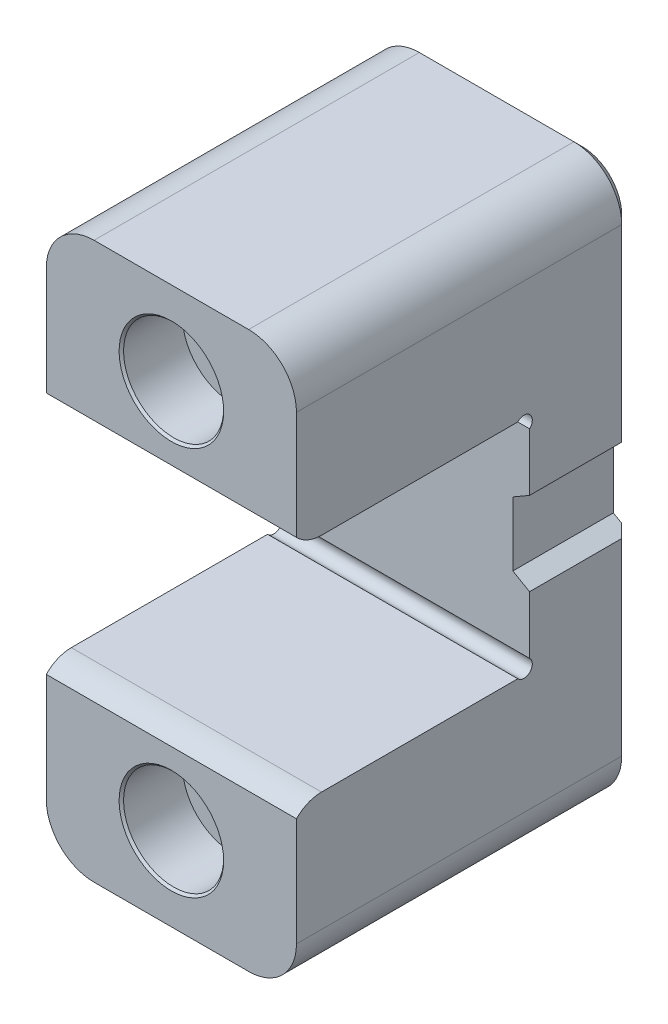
ISO-10303-21;
HEADER;
FILE_DESCRIPTION(('STEP AP214'),'2;1');
FILE_NAME('part.step','',(''),(''),'','','');
FILE_SCHEMA(('AUTOMOTIVE_DESIGN { 1 0 10303 214 1 1 1 1 }'));
ENDSEC;
DATA;
#1=APPLICATION_CONTEXT('core data for automotive mechanical design processes');
#2=APPLICATION_PROTOCOL_DEFINITION('international standard','automotive_design',2000,#1);
#3=PRODUCT_CONTEXT('',#1,'mechanical');
#4=PRODUCT('Part','Part','',(#3));
#5=PRODUCT_RELATED_PRODUCT_CATEGORY('part','',(#4));
#6=PRODUCT_DEFINITION_FORMATION('','',#4);
#7=PRODUCT_DEFINITION_CONTEXT('part definition',#1,'design');
#8=PRODUCT_DEFINITION('design','',#6,#7);
#9=PRODUCT_DEFINITION_SHAPE('','',#8);
#10=(LENGTH_UNIT() NAMED_UNIT(*) SI_UNIT(.MILLI.,.METRE.));
#11=(NAMED_UNIT(*) PLANE_ANGLE_UNIT() SI_UNIT($,.RADIAN.));
#12=(NAMED_UNIT(*) SI_UNIT($,.STERADIAN.) SOLID_ANGLE_UNIT());
#13=UNCERTAINTY_MEASURE_WITH_UNIT(LENGTH_MEASURE(1.E-05),#10,'distance_accuracy_value','');
#14=(GEOMETRIC_REPRESENTATION_CONTEXT(3) GLOBAL_UNCERTAINTY_ASSIGNED_CONTEXT((#13)) GLOBAL_UNIT_ASSIGNED_CONTEXT((#10,
#11,#12)) REPRESENTATION_CONTEXT('',''));
#15=CARTESIAN_POINT('',(0.,0.,0.));
#16=DIRECTION('',(0.,0.,1.));
#17=DIRECTION('',(1.,0.,0.));
#18=AXIS2_PLACEMENT_3D('',#15,#16,#17);
#19=CARTESIAN_POINT('',(22.5,-20.,0.));
#20=DIRECTION('',(-1.,0.,0.));
#21=DIRECTION('',(0.,0.,1.));
#22=AXIS2_PLACEMENT_3D('',#19,#20,#21);
#23=PLANE('',#22);
#24=DIRECTION('',(0.,0.,1.));
#25=VECTOR('',#24,1.);
#26=CARTESIAN_POINT('',(22.5,7.5,-60.));
#27=LINE('',#26,#25);
#28=CARTESIAN_POINT('',(22.5,7.5,-58.5));
#29=VERTEX_POINT('',#28);
#30=CARTESIAN_POINT('',(22.5,7.5,-41.92));
#31=VERTEX_POINT('',#30);
#32=EDGE_CURVE('E419',#29,#31,#27,.T.);
#33=ORIENTED_EDGE('',*,*,#32,.F.);
#34=DIRECTION('',(0.,1.,0.));
#35=VECTOR('',#34,1.);
#36=CARTESIAN_POINT('',(22.5,-20.,-58.5));
#37=LINE('',#36,#35);
#38=CARTESIAN_POINT('',(22.5,41.4,-58.5));
#39=VERTEX_POINT('',#38);
#40=EDGE_CURVE('E295',#29,#39,#37,.T.);
#41=ORIENTED_EDGE('',*,*,#40,.T.);
#42=DIRECTION('',(0.,0.,1.));
#43=VECTOR('',#42,1.);
#44=CARTESIAN_POINT('',(22.5,41.4,0.));
#45=LINE('',#44,#43);
#46=CARTESIAN_POINT('',(22.5,41.4,0.));
#47=VERTEX_POINT('',#46);
#48=EDGE_CURVE('E243',#39,#47,#45,.T.);
#49=ORIENTED_EDGE('',*,*,#48,.T.);
#50=DIRECTION('',(0.,-1.,0.));
#51=VECTOR('',#50,1.);
#52=CARTESIAN_POINT('',(22.5,50.,0.));
#53=LINE('',#52,#51);
#54=CARTESIAN_POINT('',(22.5,21.9169947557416,0.));
#55=VERTEX_POINT('',#54);
#56=EDGE_CURVE('E230',#47,#55,#53,.T.);
#57=ORIENTED_EDGE('',*,*,#56,.T.);
#58=CARTESIAN_POINT('',(22.5,26.2402017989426,-4.49999992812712));
#59=DIRECTION('',(-1.,0.,0.));
#60=DIRECTION('',(0.,0.,-1.));
#61=AXIS2_PLACEMENT_3D('',#58,#59,#60);
#62=CIRCLE('',#61,6.2402017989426);
#63=CARTESIAN_POINT('',(22.5,20.,-4.49999999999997));
#64=VERTEX_POINT('',#63);
#65=EDGE_CURVE('E466',#64,#55,#62,.T.);
#66=ORIENTED_EDGE('',*,*,#65,.F.);
#67=DIRECTION('',(0.,0.,-1.));
#68=VECTOR('',#67,1.);
#69=CARTESIAN_POINT('',(22.5,20.,0.));
#70=LINE('',#69,#68);
#71=CARTESIAN_POINT('',(22.5,20.,-39.8019660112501));
#72=VERTEX_POINT('',#71);
#73=EDGE_CURVE('E434',#64,#72,#70,.T.);
#74=ORIENTED_EDGE('',*,*,#73,.T.);
#75=CARTESIAN_POINT('',(22.5,19.,-40.92));
#76=DIRECTION('',(1.,0.,0.));
#77=DIRECTION('',(0.,0.,-1.));
#78=AXIS2_PLACEMENT_3D('',#75,#76,#77);
#79=CIRCLE('',#78,1.5);
#80=CARTESIAN_POINT('',(22.5,17.8819660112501,-41.92));
#81=VERTEX_POINT('',#80);
#82=EDGE_CURVE('E464',#81,#72,#79,.T.);
#83=ORIENTED_EDGE('',*,*,#82,.F.);
#84=DIRECTION('',(0.,-1.,0.));
#85=VECTOR('',#84,1.);
#86=CARTESIAN_POINT('',(22.5,20.,-41.92));
#87=LINE('',#86,#85);
#88=EDGE_CURVE('E438',#81,#31,#87,.T.);
#89=ORIENTED_EDGE('',*,*,#88,.T.);
#90=EDGE_LOOP('',(#33,#41,#49,#57,#66,#74,#83,#89));
#91=FACE_BOUND('',#90,.T.);
#92=ADVANCED_FACE('F33',(#91),#23,.F.);
#93=CARTESIAN_POINT('',(22.5,50.,0.));
#94=DIRECTION('',(0.,0.,-1.));
#95=DIRECTION('',(0.,1.,0.));
#96=AXIS2_PLACEMENT_3D('',#93,#94,#95);
#97=PLANE('',#96);
#98=CARTESIAN_POINT('',(0.,35.,0.));
#99=DIRECTION('',(0.,0.,-1.));
#100=DIRECTION('',(0.,1.,0.));
#101=AXIS2_PLACEMENT_3D('',#98,#99,#100);
#102=CIRCLE('',#101,9.40000000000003);
#103=CARTESIAN_POINT('',(0.,44.4,0.));
#104=VERTEX_POINT('',#103);
#105=EDGE_CURVE('E11',#104,#104,#102,.T.);
#106=ORIENTED_EDGE('',*,*,#105,.T.);
#107=EDGE_LOOP('',(#106));
#108=FACE_BOUND('',#107,.T.);
#109=DIRECTION('',(0.,-1.,0.));
#110=VECTOR('',#109,1.);
#111=CARTESIAN_POINT('',(-22.5,50.,0.));
#112=LINE('',#111,#110);
#113=CARTESIAN_POINT('',(-22.5,41.4,0.));
#114=VERTEX_POINT('',#113);
#115=CARTESIAN_POINT('',(-22.5,21.9169947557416,0.));
#116=VERTEX_POINT('',#115);
#117=EDGE_CURVE('E431',#114,#116,#112,.T.);
#118=ORIENTED_EDGE('',*,*,#117,.T.);
#119=DIRECTION('',(1.,0.,0.));
#120=VECTOR('',#119,1.);
#121=CARTESIAN_POINT('',(-22.5,21.9169947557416,0.));
#122=LINE('',#121,#120);
#123=EDGE_CURVE('E472',#116,#55,#122,.T.);
#124=ORIENTED_EDGE('',*,*,#123,.T.);
#125=ORIENTED_EDGE('',*,*,#56,.F.);
#126=CARTESIAN_POINT('',(13.9,41.4,0.));
#127=DIRECTION('',(0.,0.,-1.));
#128=DIRECTION('',(0.,1.,0.));
#129=AXIS2_PLACEMENT_3D('',#126,#127,#128);
#130=CIRCLE('',#129,8.6);
#131=CARTESIAN_POINT('',(13.9,50.,0.));
#132=VERTEX_POINT('',#131);
#133=EDGE_CURVE('E260',#47,#132,#130,.F.);
#134=ORIENTED_EDGE('',*,*,#133,.T.);
#135=DIRECTION('',(-1.,0.,0.));
#136=VECTOR('',#135,1.);
#137=CARTESIAN_POINT('',(22.5,50.,0.));
#138=LINE('',#137,#136);
#139=CARTESIAN_POINT('',(-13.9,50.,0.));
#140=VERTEX_POINT('',#139);
#141=EDGE_CURVE('E236',#132,#140,#138,.T.);
#142=ORIENTED_EDGE('',*,*,#141,.T.);
#143=CARTESIAN_POINT('',(-13.9,41.4,0.));
#144=DIRECTION('',(0.,0.,-1.));
#145=DIRECTION('',(0.,1.,0.));
#146=AXIS2_PLACEMENT_3D('',#143,#144,#145);
#147=CIRCLE('',#146,8.6);
#148=EDGE_CURVE('E258',#140,#114,#147,.F.);
#149=ORIENTED_EDGE('',*,*,#148,.T.);
#150=EDGE_LOOP('',(#118,#124,#125,#134,#142,#149));
#151=FACE_BOUND('',#150,.T.);
#152=ADVANCED_FACE('F357',(#108,#151),#97,.F.);
#153=CARTESIAN_POINT('',(22.5,20.,0.));
#154=DIRECTION('',(0.,1.,0.));
#155=DIRECTION('',(0.,0.,1.));
#156=AXIS2_PLACEMENT_3D('',#153,#154,#155);
#157=PLANE('',#156);
#158=DIRECTION('',(0.,0.,-1.));
#159=VECTOR('',#158,1.);
#160=CARTESIAN_POINT('',(-22.5,20.,0.));
#161=LINE('',#160,#159);
#162=CARTESIAN_POINT('',(-22.5,20.,-4.49999999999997));
#163=VERTEX_POINT('',#162);
#164=CARTESIAN_POINT('',(-22.5,20.,-39.8019660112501));
#165=VERTEX_POINT('',#164);
#166=EDGE_CURVE('E232',#163,#165,#161,.T.);
#167=ORIENTED_EDGE('',*,*,#166,.T.);
#168=DIRECTION('',(1.,0.,0.));
#169=VECTOR('',#168,1.);
#170=CARTESIAN_POINT('',(-22.5,20.,-39.8019660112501));
#171=LINE('',#170,#169);
#172=EDGE_CURVE('E450',#165,#72,#171,.T.);
#173=ORIENTED_EDGE('',*,*,#172,.T.);
#174=ORIENTED_EDGE('',*,*,#73,.F.);
#175=DIRECTION('',(1.,0.,0.));
#176=VECTOR('',#175,1.);
#177=CARTESIAN_POINT('',(-22.5,20.,-4.49999999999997));
#178=LINE('',#177,#176);
#179=EDGE_CURVE('E451',#163,#64,#178,.T.);
#180=ORIENTED_EDGE('',*,*,#179,.F.);
#181=EDGE_LOOP('',(#167,#173,#174,#180));
#182=FACE_BOUND('',#181,.T.);
#183=ADVANCED_FACE('F364',(#182),#157,.F.);
#184=CARTESIAN_POINT('',(22.5,20.,-41.92));
#185=DIRECTION('',(0.,0.,-1.));
#186=DIRECTION('',(-1.,0.,0.));
#187=AXIS2_PLACEMENT_3D('',#184,#185,#186);
#188=PLANE('',#187);
#189=DIRECTION('',(0.,-1.,0.));
#190=VECTOR('',#189,1.);
#191=CARTESIAN_POINT('',(-22.5,20.,-41.92));
#192=LINE('',#191,#190);
#193=CARTESIAN_POINT('',(-22.5,17.8819660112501,-41.92));
#194=VERTEX_POINT('',#193);
#195=CARTESIAN_POINT('',(-22.5,-17.8819660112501,-41.92));
#196=VERTEX_POINT('',#195);
#197=EDGE_CURVE('E227',#194,#196,#192,.T.);
#198=ORIENTED_EDGE('',*,*,#197,.T.);
#199=DIRECTION('',(1.,0.,0.));
#200=VECTOR('',#199,1.);
#201=CARTESIAN_POINT('',(-22.5,-17.8819660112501,-41.92));
#202=LINE('',#201,#200);
#203=CARTESIAN_POINT('',(22.5,-17.8819660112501,-41.92));
#204=VERTEX_POINT('',#203);
#205=EDGE_CURVE('E207',#196,#204,#202,.T.);
#206=ORIENTED_EDGE('',*,*,#205,.T.);
#207=CARTESIAN_POINT('',(22.5,-7.5,-41.92));
#208=VERTEX_POINT('',#207);
#209=EDGE_CURVE('E437',#208,#204,#87,.T.);
#210=ORIENTED_EDGE('',*,*,#209,.F.);
#211=DIRECTION('',(-0.866025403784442,0.499999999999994,0.));
#212=VECTOR('',#211,1.);
#213=CARTESIAN_POINT('',(10.5921506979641,-0.625000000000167,-41.92));
#214=LINE('',#213,#212);
#215=CARTESIAN_POINT('',(19.5,-5.76794919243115,-41.92));
#216=VERTEX_POINT('',#215);
#217=EDGE_CURVE('E418',#208,#216,#214,.T.);
#218=ORIENTED_EDGE('',*,*,#217,.T.);
#219=DIRECTION('',(0.,1.,0.));
#220=VECTOR('',#219,1.);
#221=CARTESIAN_POINT('',(19.5,20.,-41.92));
#222=LINE('',#221,#220);
#223=CARTESIAN_POINT('',(19.5,5.76794919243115,-41.92));
#224=VERTEX_POINT('',#223);
#225=EDGE_CURVE('E428',#216,#224,#222,.T.);
#226=ORIENTED_EDGE('',*,*,#225,.T.);
#227=DIRECTION('',(0.866025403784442,0.499999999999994,0.));
#228=VECTOR('',#227,1.);
#229=CARTESIAN_POINT('',(27.9126587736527,10.6249999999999,-41.92));
#230=LINE('',#229,#228);
#231=EDGE_CURVE('E425',#224,#31,#230,.T.);
#232=ORIENTED_EDGE('',*,*,#231,.T.);
#233=ORIENTED_EDGE('',*,*,#88,.F.);
#234=DIRECTION('',(1.,0.,0.));
#235=VECTOR('',#234,1.);
#236=CARTESIAN_POINT('',(-22.5,17.8819660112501,-41.92));
#237=LINE('',#236,#235);
#238=EDGE_CURVE('E459',#81,#194,#237,.F.);
#239=ORIENTED_EDGE('',*,*,#238,.T.);
#240=EDGE_LOOP('',(#198,#206,#210,#218,#226,#232,#233,#239));
#241=FACE_BOUND('',#240,.T.);
#242=ADVANCED_FACE('F463',(#241),#188,.F.);
#243=CARTESIAN_POINT('',(22.5,-20.,-41.92));
#244=DIRECTION('',(0.,-1.,0.));
#245=DIRECTION('',(0.,0.,-1.));
#246=AXIS2_PLACEMENT_3D('',#243,#244,#245);
#247=PLANE('',#246);
#248=DIRECTION('',(0.,0.,1.));
#249=VECTOR('',#248,1.);
#250=CARTESIAN_POINT('',(22.5,-20.,-41.92));
#251=LINE('',#250,#249);
#252=CARTESIAN_POINT('',(22.5,-20.,-39.8019660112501));
#253=VERTEX_POINT('',#252);
#254=CARTESIAN_POINT('',(22.5,-20.,-4.49999999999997));
#255=VERTEX_POINT('',#254);
#256=EDGE_CURVE('E220',#253,#255,#251,.T.);
#257=ORIENTED_EDGE('',*,*,#256,.F.);
#258=DIRECTION('',(1.,0.,0.));
#259=VECTOR('',#258,1.);
#260=CARTESIAN_POINT('',(-22.5,-20.,-39.8019660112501));
#261=LINE('',#260,#259);
#262=CARTESIAN_POINT('',(-22.5,-20.,-39.8019660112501));
#263=VERTEX_POINT('',#262);
#264=EDGE_CURVE('E204',#253,#263,#261,.F.);
#265=ORIENTED_EDGE('',*,*,#264,.T.);
#266=DIRECTION('',(0.,0.,1.));
#267=VECTOR('',#266,1.);
#268=CARTESIAN_POINT('',(-22.5,-20.,-41.92));
#269=LINE('',#268,#267);
#270=CARTESIAN_POINT('',(-22.5,-20.,-4.49999999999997));
#271=VERTEX_POINT('',#270);
#272=EDGE_CURVE('E218',#263,#271,#269,.T.);
#273=ORIENTED_EDGE('',*,*,#272,.T.);
#274=DIRECTION('',(1.,0.,0.));
#275=VECTOR('',#274,1.);
#276=CARTESIAN_POINT('',(-22.5,-20.,-4.49999999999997));
#277=LINE('',#276,#275);
#278=EDGE_CURVE('E479',#271,#255,#277,.T.);
#279=ORIENTED_EDGE('',*,*,#278,.T.);
#280=EDGE_LOOP('',(#257,#265,#273,#279));
#281=FACE_BOUND('',#280,.T.);
#282=ADVANCED_FACE('F216',(#281),#247,.F.);
#283=CARTESIAN_POINT('',(22.5,-20.,0.));
#284=DIRECTION('',(0.,0.,-1.));
#285=DIRECTION('',(0.,1.,0.));
#286=AXIS2_PLACEMENT_3D('',#283,#284,#285);
#287=PLANE('',#286);
#288=CARTESIAN_POINT('',(0.,-35.,0.));
#289=DIRECTION('',(0.,0.,-1.));
#290=DIRECTION('',(0.,1.,0.));
#291=AXIS2_PLACEMENT_3D('',#288,#289,#290);
#292=CIRCLE('',#291,9.4);
#293=CARTESIAN_POINT('',(0.,-25.6,0.));
#294=VERTEX_POINT('',#293);
#295=EDGE_CURVE('E339',#294,#294,#292,.T.);
#296=ORIENTED_EDGE('',*,*,#295,.T.);
#297=EDGE_LOOP('',(#296));
#298=FACE_BOUND('',#297,.T.);
#299=DIRECTION('',(0.,-1.,0.));
#300=VECTOR('',#299,1.);
#301=CARTESIAN_POINT('',(22.5,-20.,0.));
#302=LINE('',#301,#300);
#303=CARTESIAN_POINT('',(22.5,-21.9169947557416,0.));
#304=VERTEX_POINT('',#303);
#305=CARTESIAN_POINT('',(22.5,-41.4,0.));
#306=VERTEX_POINT('',#305);
#307=EDGE_CURVE('E240',#304,#306,#302,.T.);
#308=ORIENTED_EDGE('',*,*,#307,.F.);
#309=DIRECTION('',(1.,0.,0.));
#310=VECTOR('',#309,1.);
#311=CARTESIAN_POINT('',(-22.5,-21.9169947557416,0.));
#312=LINE('',#311,#310);
#313=CARTESIAN_POINT('',(-22.5,-21.9169947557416,0.));
#314=VERTEX_POINT('',#313);
#315=EDGE_CURVE('E411',#314,#304,#312,.T.);
#316=ORIENTED_EDGE('',*,*,#315,.F.);
#317=DIRECTION('',(0.,-1.,0.));
#318=VECTOR('',#317,1.);
#319=CARTESIAN_POINT('',(-22.5,-20.,0.));
#320=LINE('',#319,#318);
#321=CARTESIAN_POINT('',(-22.5,-41.4,0.));
#322=VERTEX_POINT('',#321);
#323=EDGE_CURVE('E226',#314,#322,#320,.T.);
#324=ORIENTED_EDGE('',*,*,#323,.T.);
#325=CARTESIAN_POINT('',(-13.9,-41.4,0.));
#326=DIRECTION('',(0.,0.,-1.));
#327=DIRECTION('',(0.,1.,0.));
#328=AXIS2_PLACEMENT_3D('',#325,#326,#327);
#329=CIRCLE('',#328,8.6);
#330=CARTESIAN_POINT('',(-13.9,-50.,0.));
#331=VERTEX_POINT('',#330);
#332=EDGE_CURVE('E253',#322,#331,#329,.F.);
#333=ORIENTED_EDGE('',*,*,#332,.T.);
#334=DIRECTION('',(-1.,0.,0.));
#335=VECTOR('',#334,1.);
#336=CARTESIAN_POINT('',(22.5,-50.,0.));
#337=LINE('',#336,#335);
#338=CARTESIAN_POINT('',(13.9,-50.,0.));
#339=VERTEX_POINT('',#338);
#340=EDGE_CURVE('E239',#339,#331,#337,.T.);
#341=ORIENTED_EDGE('',*,*,#340,.F.);
#342=CARTESIAN_POINT('',(13.9,-41.4,0.));
#343=DIRECTION('',(0.,0.,-1.));
#344=DIRECTION('',(0.,1.,0.));
#345=AXIS2_PLACEMENT_3D('',#342,#343,#344);
#346=CIRCLE('',#345,8.6);
#347=EDGE_CURVE('E255',#339,#306,#346,.F.);
#348=ORIENTED_EDGE('',*,*,#347,.T.);
#349=EDGE_LOOP('',(#308,#316,#324,#333,#341,#348));
#350=FACE_BOUND('',#349,.T.);
#351=ADVANCED_FACE('F486',(#298,#350),#287,.F.);
#352=CARTESIAN_POINT('',(22.5,-50.,0.));
#353=DIRECTION('',(0.,1.,0.));
#354=DIRECTION('',(0.,0.,1.));
#355=AXIS2_PLACEMENT_3D('',#352,#353,#354);
#356=PLANE('',#355);
#357=DIRECTION('',(0.,0.,-1.));
#358=VECTOR('',#357,1.);
#359=CARTESIAN_POINT('',(-13.9,-50.,-60.));
#360=LINE('',#359,#358);
#361=CARTESIAN_POINT('',(-13.9,-50.,-58.5));
#362=VERTEX_POINT('',#361);
#363=EDGE_CURVE('E248',#331,#362,#360,.T.);
#364=ORIENTED_EDGE('',*,*,#363,.T.);
#365=DIRECTION('',(1.,0.,0.));
#366=VECTOR('',#365,1.);
#367=CARTESIAN_POINT('',(22.5,-50.,-58.5));
#368=LINE('',#367,#366);
#369=CARTESIAN_POINT('',(13.9,-50.,-58.5));
#370=VERTEX_POINT('',#369);
#371=EDGE_CURVE('E303',#362,#370,#368,.T.);
#372=ORIENTED_EDGE('',*,*,#371,.T.);
#373=DIRECTION('',(0.,0.,-1.));
#374=VECTOR('',#373,1.);
#375=CARTESIAN_POINT('',(13.9,-50.,0.));
#376=LINE('',#375,#374);
#377=EDGE_CURVE('E251',#370,#339,#376,.F.);
#378=ORIENTED_EDGE('',*,*,#377,.T.);
#379=ORIENTED_EDGE('',*,*,#340,.T.);
#380=EDGE_LOOP('',(#364,#372,#378,#379));
#381=FACE_BOUND('',#380,.T.);
#382=ADVANCED_FACE('F685',(#381),#356,.F.);
#383=CARTESIAN_POINT('',(22.5,50.,-60.));
#384=DIRECTION('',(0.,0.,1.));
#385=DIRECTION('',(1.,0.,0.));
#386=AXIS2_PLACEMENT_3D('',#383,#384,#385);
#387=PLANE('',#386);
#388=DIRECTION('',(0.866025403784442,-0.499999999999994,0.));
#389=VECTOR('',#388,1.);
#390=CARTESIAN_POINT('',(19.5,-5.76794919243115,-60.));
#391=LINE('',#390,#389);
#392=CARTESIAN_POINT('',(19.5,-5.76794919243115,-60.));
#393=VERTEX_POINT('',#392);
#394=CARTESIAN_POINT('',(21.,-6.63397459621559,-60.));
#395=VERTEX_POINT('',#394);
#396=EDGE_CURVE('E399',#393,#395,#391,.T.);
#397=ORIENTED_EDGE('',*,*,#396,.T.);
#398=DIRECTION('',(0.,-1.,0.));
#399=VECTOR('',#398,1.);
#400=CARTESIAN_POINT('',(21.,50.,-60.));
#401=LINE('',#400,#399);
#402=CARTESIAN_POINT('',(21.,-41.4,-60.));
#403=VERTEX_POINT('',#402);
#404=EDGE_CURVE('E293',#395,#403,#401,.T.);
#405=ORIENTED_EDGE('',*,*,#404,.T.);
#406=CARTESIAN_POINT('',(13.9,-41.4,-60.));
#407=DIRECTION('',(0.,0.,1.));
#408=DIRECTION('',(1.,0.,0.));
#409=AXIS2_PLACEMENT_3D('',#406,#407,#408);
#410=CIRCLE('',#409,7.10000000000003);
#411=CARTESIAN_POINT('',(13.9,-48.5,-60.));
#412=VERTEX_POINT('',#411);
#413=EDGE_CURVE('E289',#403,#412,#410,.F.);
#414=ORIENTED_EDGE('',*,*,#413,.T.);
#415=DIRECTION('',(-1.,0.,0.));
#416=VECTOR('',#415,1.);
#417=CARTESIAN_POINT('',(22.5,-48.5,-60.));
#418=LINE('',#417,#416);
#419=CARTESIAN_POINT('',(-13.9,-48.5,-60.));
#420=VERTEX_POINT('',#419);
#421=EDGE_CURVE('E285',#412,#420,#418,.T.);
#422=ORIENTED_EDGE('',*,*,#421,.T.);
#423=CARTESIAN_POINT('',(-13.9,-41.4,-60.));
#424=DIRECTION('',(0.,0.,1.));
#425=DIRECTION('',(1.,0.,0.));
#426=AXIS2_PLACEMENT_3D('',#423,#424,#425);
#427=CIRCLE('',#426,7.10000000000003);
#428=CARTESIAN_POINT('',(-21.,-41.4,-60.));
#429=VERTEX_POINT('',#428);
#430=EDGE_CURVE('E283',#420,#429,#427,.F.);
#431=ORIENTED_EDGE('',*,*,#430,.T.);
#432=DIRECTION('',(0.,1.,0.));
#433=VECTOR('',#432,1.);
#434=CARTESIAN_POINT('',(-21.,41.4,-60.));
#435=LINE('',#434,#433);
#436=CARTESIAN_POINT('',(-21.,41.4,-60.));
#437=VERTEX_POINT('',#436);
#438=EDGE_CURVE('E279',#429,#437,#435,.T.);
#439=ORIENTED_EDGE('',*,*,#438,.T.);
#440=CARTESIAN_POINT('',(-13.9,41.4,-60.));
#441=DIRECTION('',(0.,0.,1.));
#442=DIRECTION('',(1.,0.,0.));
#443=AXIS2_PLACEMENT_3D('',#440,#441,#442);
#444=CIRCLE('',#443,7.10000000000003);
#445=CARTESIAN_POINT('',(-13.9,48.5,-60.));
#446=VERTEX_POINT('',#445);
#447=EDGE_CURVE('E277',#437,#446,#444,.F.);
#448=ORIENTED_EDGE('',*,*,#447,.T.);
#449=DIRECTION('',(1.,0.,0.));
#450=VECTOR('',#449,1.);
#451=CARTESIAN_POINT('',(22.5,48.5,-60.));
#452=LINE('',#451,#450);
#453=CARTESIAN_POINT('',(13.9,48.5,-60.));
#454=VERTEX_POINT('',#453);
#455=EDGE_CURVE('E281',#446,#454,#452,.T.);
#456=ORIENTED_EDGE('',*,*,#455,.T.);
#457=CARTESIAN_POINT('',(13.9,41.4,-60.));
#458=DIRECTION('',(0.,0.,1.));
#459=DIRECTION('',(1.,0.,0.));
#460=AXIS2_PLACEMENT_3D('',#457,#458,#459);
#461=CIRCLE('',#460,7.10000000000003);
#462=CARTESIAN_POINT('',(21.,41.4,-60.));
#463=VERTEX_POINT('',#462);
#464=EDGE_CURVE('E287',#454,#463,#461,.F.);
#465=ORIENTED_EDGE('',*,*,#464,.T.);
#466=DIRECTION('',(0.,-1.,0.));
#467=VECTOR('',#466,1.);
#468=CARTESIAN_POINT('',(21.,50.,-60.));
#469=LINE('',#468,#467);
#470=CARTESIAN_POINT('',(21.,6.63397459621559,-60.));
#471=VERTEX_POINT('',#470);
#472=EDGE_CURVE('E291',#463,#471,#469,.T.);
#473=ORIENTED_EDGE('',*,*,#472,.T.);
#474=DIRECTION('',(-0.866025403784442,-0.499999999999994,0.));
#475=VECTOR('',#474,1.);
#476=CARTESIAN_POINT('',(19.5,5.76794919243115,-60.));
#477=LINE('',#476,#475);
#478=CARTESIAN_POINT('',(19.5,5.76794919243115,-60.));
#479=VERTEX_POINT('',#478);
#480=EDGE_CURVE('E407',#471,#479,#477,.T.);
#481=ORIENTED_EDGE('',*,*,#480,.T.);
#482=DIRECTION('',(0.,-1.,0.));
#483=VECTOR('',#482,1.);
#484=CARTESIAN_POINT('',(19.5,-5.76794919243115,-60.));
#485=LINE('',#484,#483);
#486=EDGE_CURVE('E406',#479,#393,#485,.T.);
#487=ORIENTED_EDGE('',*,*,#486,.T.);
#488=EDGE_LOOP('',(#397,#405,#414,#422,#431,#439,#448,#456,#465,#473,#481,#487));
#489=FACE_BOUND('',#488,.T.);
#490=CARTESIAN_POINT('',(0.,35.,-60.));
#491=DIRECTION('',(0.,0.,1.));
#492=DIRECTION('',(1.,0.,0.));
#493=AXIS2_PLACEMENT_3D('',#490,#491,#492);
#494=CIRCLE('',#493,5.49999999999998);
#495=CARTESIAN_POINT('',(5.49999999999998,35.,-60.));
#496=VERTEX_POINT('',#495);
#497=EDGE_CURVE('E543',#496,#496,#494,.T.);
#498=ORIENTED_EDGE('',*,*,#497,.T.);
#499=EDGE_LOOP('',(#498));
#500=FACE_BOUND('',#499,.T.);
#501=CARTESIAN_POINT('',(0.,-35.,-60.));
#502=DIRECTION('',(0.,0.,1.));
#503=DIRECTION('',(1.,0.,0.));
#504=AXIS2_PLACEMENT_3D('',#501,#502,#503);
#505=CIRCLE('',#504,5.49999999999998);
#506=CARTESIAN_POINT('',(5.49999999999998,-35.,-60.));
#507=VERTEX_POINT('',#506);
#508=EDGE_CURVE('E532',#507,#507,#505,.T.);
#509=ORIENTED_EDGE('',*,*,#508,.T.);
#510=EDGE_LOOP('',(#509));
#511=FACE_BOUND('',#510,.T.);
#512=ADVANCED_FACE('F378',(#489,#500,#511),#387,.F.);
#513=CARTESIAN_POINT('',(22.5,50.,0.));
#514=DIRECTION('',(0.,-1.,0.));
#515=DIRECTION('',(0.,0.,-1.));
#516=AXIS2_PLACEMENT_3D('',#513,#514,#515);
#517=PLANE('',#516);
#518=DIRECTION('',(0.,0.,1.));
#519=VECTOR('',#518,1.);
#520=CARTESIAN_POINT('',(13.9,50.,0.));
#521=LINE('',#520,#519);
#522=CARTESIAN_POINT('',(13.9,50.,-58.5));
#523=VERTEX_POINT('',#522);
#524=EDGE_CURVE('E264',#132,#523,#521,.F.);
#525=ORIENTED_EDGE('',*,*,#524,.T.);
#526=DIRECTION('',(-1.,0.,0.));
#527=VECTOR('',#526,1.);
#528=CARTESIAN_POINT('',(22.5,50.,-58.5));
#529=LINE('',#528,#527);
#530=CARTESIAN_POINT('',(-13.9,50.,-58.5));
#531=VERTEX_POINT('',#530);
#532=EDGE_CURVE('E56',#523,#531,#529,.T.);
#533=ORIENTED_EDGE('',*,*,#532,.T.);
#534=DIRECTION('',(0.,0.,1.));
#535=VECTOR('',#534,1.);
#536=CARTESIAN_POINT('',(-13.9,50.,0.));
#537=LINE('',#536,#535);
#538=EDGE_CURVE('E262',#531,#140,#537,.T.);
#539=ORIENTED_EDGE('',*,*,#538,.T.);
#540=ORIENTED_EDGE('',*,*,#141,.F.);
#541=EDGE_LOOP('',(#525,#533,#539,#540));
#542=FACE_BOUND('',#541,.T.);
#543=ADVANCED_FACE('F371',(#542),#517,.F.);
#544=DIRECTION('',(0.,0.,-1.));
#545=VECTOR('',#544,1.);
#546=CARTESIAN_POINT('',(22.5,-41.4,0.));
#547=LINE('',#546,#545);
#548=CARTESIAN_POINT('',(22.5,-41.4,-58.5));
#549=VERTEX_POINT('',#548);
#550=EDGE_CURVE('E245',#306,#549,#547,.T.);
#551=ORIENTED_EDGE('',*,*,#550,.T.);
#552=DIRECTION('',(0.,1.,0.));
#553=VECTOR('',#552,1.);
#554=CARTESIAN_POINT('',(22.5,-20.,-58.5));
#555=LINE('',#554,#553);
#556=CARTESIAN_POINT('',(22.5,-7.5,-58.5));
#557=VERTEX_POINT('',#556);
#558=EDGE_CURVE('E272',#549,#557,#555,.T.);
#559=ORIENTED_EDGE('',*,*,#558,.T.);
#560=DIRECTION('',(0.,0.,1.));
#561=VECTOR('',#560,1.);
#562=CARTESIAN_POINT('',(22.5,-7.5,-60.));
#563=LINE('',#562,#561);
#564=EDGE_CURVE('E402',#557,#208,#563,.T.);
#565=ORIENTED_EDGE('',*,*,#564,.T.);
#566=ORIENTED_EDGE('',*,*,#209,.T.);
#567=CARTESIAN_POINT('',(22.5,-19.,-40.92));
#568=DIRECTION('',(1.,0.,0.));
#569=DIRECTION('',(0.,0.,1.));
#570=AXIS2_PLACEMENT_3D('',#567,#568,#569);
#571=CIRCLE('',#570,1.5);
#572=EDGE_CURVE('E212',#253,#204,#571,.T.);
#573=ORIENTED_EDGE('',*,*,#572,.F.);
#574=ORIENTED_EDGE('',*,*,#256,.T.);
#575=CARTESIAN_POINT('',(22.5,-26.2402017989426,-4.49999992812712));
#576=DIRECTION('',(-1.,0.,0.));
#577=DIRECTION('',(0.,0.,1.));
#578=AXIS2_PLACEMENT_3D('',#575,#576,#577);
#579=CIRCLE('',#578,6.2402017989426);
#580=EDGE_CURVE('E475',#304,#255,#579,.T.);
#581=ORIENTED_EDGE('',*,*,#580,.F.);
#582=ORIENTED_EDGE('',*,*,#307,.T.);
#583=EDGE_LOOP('',(#551,#559,#565,#566,#573,#574,#581,#582));
#584=FACE_BOUND('',#583,.T.);
#585=ADVANCED_FACE('F360',(#584),#23,.F.);
#586=CARTESIAN_POINT('',(-22.5,-20.,0.));
#587=DIRECTION('',(-1.,0.,0.));
#588=DIRECTION('',(0.,0.,1.));
#589=AXIS2_PLACEMENT_3D('',#586,#587,#588);
#590=PLANE('',#589);
#591=DIRECTION('',(0.,0.,1.));
#592=VECTOR('',#591,1.);
#593=CARTESIAN_POINT('',(-22.5,41.4,-60.));
#594=LINE('',#593,#592);
#595=CARTESIAN_POINT('',(-22.5,41.4,-58.5));
#596=VERTEX_POINT('',#595);
#597=EDGE_CURVE('E266',#114,#596,#594,.F.);
#598=ORIENTED_EDGE('',*,*,#597,.T.);
#599=DIRECTION('',(0.,-1.,0.));
#600=VECTOR('',#599,1.);
#601=CARTESIAN_POINT('',(-22.5,-41.4,-58.5));
#602=LINE('',#601,#600);
#603=CARTESIAN_POINT('',(-22.5,-41.4,-58.5));
#604=VERTEX_POINT('',#603);
#605=EDGE_CURVE('E308',#596,#604,#602,.T.);
#606=ORIENTED_EDGE('',*,*,#605,.T.);
#607=DIRECTION('',(0.,0.,-1.));
#608=VECTOR('',#607,1.);
#609=CARTESIAN_POINT('',(-22.5,-41.4,0.));
#610=LINE('',#609,#608);
#611=EDGE_CURVE('E268',#604,#322,#610,.F.);
#612=ORIENTED_EDGE('',*,*,#611,.T.);
#613=ORIENTED_EDGE('',*,*,#323,.F.);
#614=CARTESIAN_POINT('',(-22.5,-26.2402017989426,-4.49999992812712));
#615=DIRECTION('',(-1.,0.,0.));
#616=DIRECTION('',(0.,0.,1.));
#617=AXIS2_PLACEMENT_3D('',#614,#615,#616);
#618=CIRCLE('',#617,6.2402017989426);
#619=EDGE_CURVE('E225',#314,#271,#618,.T.);
#620=ORIENTED_EDGE('',*,*,#619,.T.);
#621=ORIENTED_EDGE('',*,*,#272,.F.);
#622=CARTESIAN_POINT('',(-22.5,-19.,-40.92));
#623=DIRECTION('',(1.,0.,0.));
#624=DIRECTION('',(0.,0.,1.));
#625=AXIS2_PLACEMENT_3D('',#622,#623,#624);
#626=CIRCLE('',#625,1.5);
#627=EDGE_CURVE('E201',#263,#196,#626,.T.);
#628=ORIENTED_EDGE('',*,*,#627,.T.);
#629=ORIENTED_EDGE('',*,*,#197,.F.);
#630=CARTESIAN_POINT('',(-22.5,19.,-40.92));
#631=DIRECTION('',(-1.,0.,0.));
#632=DIRECTION('',(0.,0.,1.));
#633=AXIS2_PLACEMENT_3D('',#630,#631,#632);
#634=CIRCLE('',#633,1.5);
#635=EDGE_CURVE('E270',#165,#194,#634,.T.);
#636=ORIENTED_EDGE('',*,*,#635,.F.);
#637=ORIENTED_EDGE('',*,*,#166,.F.);
#638=CARTESIAN_POINT('',(-22.5,26.2402017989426,-4.49999992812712));
#639=DIRECTION('',(-1.,0.,0.));
#640=DIRECTION('',(0.,0.,-1.));
#641=AXIS2_PLACEMENT_3D('',#638,#639,#640);
#642=CIRCLE('',#641,6.2402017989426);
#643=EDGE_CURVE('E455',#163,#116,#642,.T.);
#644=ORIENTED_EDGE('',*,*,#643,.T.);
#645=ORIENTED_EDGE('',*,*,#117,.F.);
#646=EDGE_LOOP('',(#598,#606,#612,#613,#620,#621,#628,#629,#636,#637,#644,#645));
#647=FACE_BOUND('',#646,.T.);
#648=ADVANCED_FACE('F223',(#647),#590,.T.);
#649=CARTESIAN_POINT('',(13.9,-41.4,0.));
#650=DIRECTION('',(0.,0.,-1.));
#651=DIRECTION('',(-1.,0.,0.));
#652=AXIS2_PLACEMENT_3D('',#649,#650,#651);
#653=CYLINDRICAL_SURFACE('',#652,8.6);
#654=ORIENTED_EDGE('',*,*,#377,.F.);
#655=CARTESIAN_POINT('',(13.9,-41.4,-58.5));
#656=DIRECTION('',(0.,0.,1.));
#657=DIRECTION('',(1.,0.,0.));
#658=AXIS2_PLACEMENT_3D('',#655,#656,#657);
#659=CIRCLE('',#658,8.6);
#660=EDGE_CURVE('E299',#370,#549,#659,.T.);
#661=ORIENTED_EDGE('',*,*,#660,.T.);
#662=ORIENTED_EDGE('',*,*,#550,.F.);
#663=ORIENTED_EDGE('',*,*,#347,.F.);
#664=EDGE_LOOP('',(#654,#661,#662,#663));
#665=FACE_BOUND('',#664,.T.);
#666=ADVANCED_FACE('F377',(#665),#653,.T.);
#667=CARTESIAN_POINT('',(13.9,41.4,0.));
#668=DIRECTION('',(0.,0.,1.));
#669=DIRECTION('',(1.,0.,0.));
#670=AXIS2_PLACEMENT_3D('',#667,#668,#669);
#671=CYLINDRICAL_SURFACE('',#670,8.6);
#672=ORIENTED_EDGE('',*,*,#48,.F.);
#673=CARTESIAN_POINT('',(13.9,41.4,-58.5));
#674=DIRECTION('',(0.,0.,1.));
#675=DIRECTION('',(1.,0.,0.));
#676=AXIS2_PLACEMENT_3D('',#673,#674,#675);
#677=CIRCLE('',#676,8.6);
#678=EDGE_CURVE('E301',#39,#523,#677,.T.);
#679=ORIENTED_EDGE('',*,*,#678,.T.);
#680=ORIENTED_EDGE('',*,*,#524,.F.);
#681=ORIENTED_EDGE('',*,*,#133,.F.);
#682=EDGE_LOOP('',(#672,#679,#680,#681));
#683=FACE_BOUND('',#682,.T.);
#684=ADVANCED_FACE('F602',(#683),#671,.T.);
#685=CARTESIAN_POINT('',(-13.9,-41.4,0.));
#686=DIRECTION('',(0.,0.,1.));
#687=DIRECTION('',(1.,0.,0.));
#688=AXIS2_PLACEMENT_3D('',#685,#686,#687);
#689=CYLINDRICAL_SURFACE('',#688,8.6);
#690=ORIENTED_EDGE('',*,*,#611,.F.);
#691=CARTESIAN_POINT('',(-13.9,-41.4,-58.5));
#692=DIRECTION('',(0.,0.,1.));
#693=DIRECTION('',(1.,0.,0.));
#694=AXIS2_PLACEMENT_3D('',#691,#692,#693);
#695=CIRCLE('',#694,8.6);
#696=EDGE_CURVE('E305',#604,#362,#695,.T.);
#697=ORIENTED_EDGE('',*,*,#696,.T.);
#698=ORIENTED_EDGE('',*,*,#363,.F.);
#699=ORIENTED_EDGE('',*,*,#332,.F.);
#700=EDGE_LOOP('',(#690,#697,#698,#699));
#701=FACE_BOUND('',#700,.T.);
#702=ADVANCED_FACE('F597',(#701),#689,.T.);
#703=CARTESIAN_POINT('',(-13.9,41.4,0.));
#704=DIRECTION('',(0.,0.,-1.));
#705=DIRECTION('',(-1.,0.,0.));
#706=AXIS2_PLACEMENT_3D('',#703,#704,#705);
#707=CYLINDRICAL_SURFACE('',#706,8.6);
#708=ORIENTED_EDGE('',*,*,#538,.F.);
#709=CARTESIAN_POINT('',(-13.9,41.4,-58.5));
#710=DIRECTION('',(0.,0.,1.));
#711=DIRECTION('',(1.,0.,0.));
#712=AXIS2_PLACEMENT_3D('',#709,#710,#711);
#713=CIRCLE('',#712,8.6);
#714=EDGE_CURVE('E48',#531,#596,#713,.T.);
#715=ORIENTED_EDGE('',*,*,#714,.T.);
#716=ORIENTED_EDGE('',*,*,#597,.F.);
#717=ORIENTED_EDGE('',*,*,#148,.F.);
#718=EDGE_LOOP('',(#708,#715,#716,#717));
#719=FACE_BOUND('',#718,.T.);
#720=ADVANCED_FACE('F593',(#719),#707,.T.);
#721=CARTESIAN_POINT('',(19.5,-5.76794919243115,-60.));
#722=DIRECTION('',(-1.,0.,0.));
#723=DIRECTION('',(0.,0.,1.));
#724=AXIS2_PLACEMENT_3D('',#721,#722,#723);
#725=PLANE('',#724);
#726=DIRECTION('',(0.,0.,1.));
#727=VECTOR('',#726,1.);
#728=CARTESIAN_POINT('',(19.5,-5.76794919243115,-60.));
#729=LINE('',#728,#727);
#730=EDGE_CURVE('E409',#393,#216,#729,.T.);
#731=ORIENTED_EDGE('',*,*,#730,.F.);
#732=ORIENTED_EDGE('',*,*,#486,.F.);
#733=DIRECTION('',(0.,0.,1.));
#734=VECTOR('',#733,1.);
#735=CARTESIAN_POINT('',(19.5,5.76794919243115,-60.));
#736=LINE('',#735,#734);
#737=EDGE_CURVE('E415',#479,#224,#736,.T.);
#738=ORIENTED_EDGE('',*,*,#737,.T.);
#739=ORIENTED_EDGE('',*,*,#225,.F.);
#740=EDGE_LOOP('',(#731,#732,#738,#739));
#741=FACE_BOUND('',#740,.T.);
#742=ADVANCED_FACE('F529',(#741),#725,.F.);
#743=CARTESIAN_POINT('',(19.5,5.76794919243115,-60.));
#744=DIRECTION('',(-0.499999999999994,0.866025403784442,0.));
#745=DIRECTION('',(-0.866025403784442,-0.499999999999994,0.));
#746=AXIS2_PLACEMENT_3D('',#743,#744,#745);
#747=PLANE('',#746);
#748=ORIENTED_EDGE('',*,*,#480,.F.);
#749=DIRECTION('',(-0.654653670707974,-0.377964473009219,-0.654653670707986));
#750=VECTOR('',#749,1.);
#751=CARTESIAN_POINT('',(15.695514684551,3.57142857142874,-65.3044853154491));
#752=LINE('',#751,#750);
#753=EDGE_CURVE('E297',#471,#29,#752,.F.);
#754=ORIENTED_EDGE('',*,*,#753,.T.);
#755=ORIENTED_EDGE('',*,*,#32,.T.);
#756=ORIENTED_EDGE('',*,*,#231,.F.);
#757=ORIENTED_EDGE('',*,*,#737,.F.);
#758=EDGE_LOOP('',(#748,#754,#755,#756,#757));
#759=FACE_BOUND('',#758,.T.);
#760=ADVANCED_FACE('F527',(#759),#747,.F.);
#761=CARTESIAN_POINT('',(19.5,-5.76794919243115,-60.));
#762=DIRECTION('',(-0.499999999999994,-0.866025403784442,0.));
#763=DIRECTION('',(0.866025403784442,-0.499999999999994,0.));
#764=AXIS2_PLACEMENT_3D('',#761,#762,#763);
#765=PLANE('',#764);
#766=ORIENTED_EDGE('',*,*,#564,.F.);
#767=DIRECTION('',(0.654653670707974,-0.377964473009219,0.654653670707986));
#768=VECTOR('',#767,1.);
#769=CARTESIAN_POINT('',(25.5929478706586,-9.28571428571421,-55.4070521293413));
#770=LINE('',#769,#768);
#771=EDGE_CURVE('E275',#557,#395,#770,.F.);
#772=ORIENTED_EDGE('',*,*,#771,.T.);
#773=ORIENTED_EDGE('',*,*,#396,.F.);
#774=ORIENTED_EDGE('',*,*,#730,.T.);
#775=ORIENTED_EDGE('',*,*,#217,.F.);
#776=EDGE_LOOP('',(#766,#772,#773,#774,#775));
#777=FACE_BOUND('',#776,.T.);
#778=ADVANCED_FACE('F397',(#777),#765,.F.);
#779=CARTESIAN_POINT('',(-22.5,-26.2402017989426,-4.49999992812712));
#780=DIRECTION('',(1.,0.,0.));
#781=DIRECTION('',(0.,0.,-1.));
#782=AXIS2_PLACEMENT_3D('',#779,#780,#781);
#783=CYLINDRICAL_SURFACE('',#782,6.2402017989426);
#784=ORIENTED_EDGE('',*,*,#580,.T.);
#785=ORIENTED_EDGE('',*,*,#278,.F.);
#786=ORIENTED_EDGE('',*,*,#619,.F.);
#787=ORIENTED_EDGE('',*,*,#315,.T.);
#788=EDGE_LOOP('',(#784,#785,#786,#787));
#789=FACE_BOUND('',#788,.T.);
#790=ADVANCED_FACE('F483',(#789),#783,.T.);
#791=CARTESIAN_POINT('',(-22.5,26.2402017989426,-4.49999992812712));
#792=DIRECTION('',(1.,0.,0.));
#793=DIRECTION('',(0.,0.,-1.));
#794=AXIS2_PLACEMENT_3D('',#791,#792,#793);
#795=CYLINDRICAL_SURFACE('',#794,6.2402017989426);
#796=ORIENTED_EDGE('',*,*,#65,.T.);
#797=ORIENTED_EDGE('',*,*,#123,.F.);
#798=ORIENTED_EDGE('',*,*,#643,.F.);
#799=ORIENTED_EDGE('',*,*,#179,.T.);
#800=EDGE_LOOP('',(#796,#797,#798,#799));
#801=FACE_BOUND('',#800,.T.);
#802=ADVANCED_FACE('F583',(#801),#795,.T.);
#803=CARTESIAN_POINT('',(-22.5,19.,-40.92));
#804=DIRECTION('',(1.,0.,0.));
#805=DIRECTION('',(0.,0.,-1.));
#806=AXIS2_PLACEMENT_3D('',#803,#804,#805);
#807=CYLINDRICAL_SURFACE('',#806,1.5);
#808=ORIENTED_EDGE('',*,*,#635,.T.);
#809=ORIENTED_EDGE('',*,*,#238,.F.);
#810=ORIENTED_EDGE('',*,*,#82,.T.);
#811=ORIENTED_EDGE('',*,*,#172,.F.);
#812=EDGE_LOOP('',(#808,#809,#810,#811));
#813=FACE_BOUND('',#812,.T.);
#814=ADVANCED_FACE('F458',(#813),#807,.F.);
#815=CARTESIAN_POINT('',(-22.5,-19.,-40.92));
#816=DIRECTION('',(1.,0.,0.));
#817=DIRECTION('',(0.,0.,-1.));
#818=AXIS2_PLACEMENT_3D('',#815,#816,#817);
#819=CYLINDRICAL_SURFACE('',#818,1.5);
#820=ORIENTED_EDGE('',*,*,#627,.F.);
#821=ORIENTED_EDGE('',*,*,#264,.F.);
#822=ORIENTED_EDGE('',*,*,#572,.T.);
#823=ORIENTED_EDGE('',*,*,#205,.F.);
#824=EDGE_LOOP('',(#820,#821,#822,#823));
#825=FACE_BOUND('',#824,.T.);
#826=ADVANCED_FACE('F203',(#825),#819,.F.);
#827=CARTESIAN_POINT('',(0.,-35.,0.));
#828=DIRECTION('',(0.,0.,1.));
#829=DIRECTION('',(1.,0.,0.));
#830=AXIS2_PLACEMENT_3D('',#827,#828,#829);
#831=CYLINDRICAL_SURFACE('',#830,5.49999999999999);
#832=ORIENTED_EDGE('',*,*,#508,.F.);
#833=EDGE_LOOP('',(#832));
#834=FACE_BOUND('',#833,.T.);
#835=CARTESIAN_POINT('',(0.,-35.,-11.));
#836=DIRECTION('',(0.,0.,1.));
#837=DIRECTION('',(1.,0.,0.));
#838=AXIS2_PLACEMENT_3D('',#835,#836,#837);
#839=CIRCLE('',#838,5.5);
#840=CARTESIAN_POINT('',(5.5,-35.,-11.));
#841=VERTEX_POINT('',#840);
#842=EDGE_CURVE('E535',#841,#841,#839,.T.);
#843=ORIENTED_EDGE('',*,*,#842,.T.);
#844=EDGE_LOOP('',(#843));
#845=FACE_BOUND('',#844,.T.);
#846=ADVANCED_FACE('F574',(#834,#845),#831,.F.);
#847=CARTESIAN_POINT('',(5.5,-35.,-11.));
#848=DIRECTION('',(0.,0.,-1.));
#849=DIRECTION('',(-1.,0.,0.));
#850=AXIS2_PLACEMENT_3D('',#847,#848,#849);
#851=PLANE('',#850);
#852=ORIENTED_EDGE('',*,*,#842,.F.);
#853=EDGE_LOOP('',(#852));
#854=FACE_BOUND('',#853,.T.);
#855=CARTESIAN_POINT('',(0.,-35.,-11.));
#856=DIRECTION('',(0.,0.,1.));
#857=DIRECTION('',(1.,0.,0.));
#858=AXIS2_PLACEMENT_3D('',#855,#856,#857);
#859=CIRCLE('',#858,9.);
#860=CARTESIAN_POINT('',(9.,-35.,-11.));
#861=VERTEX_POINT('',#860);
#862=EDGE_CURVE('E540',#861,#861,#859,.T.);
#863=ORIENTED_EDGE('',*,*,#862,.T.);
#864=EDGE_LOOP('',(#863));
#865=FACE_BOUND('',#864,.T.);
#866=ADVANCED_FACE('F570',(#854,#865),#851,.F.);
#867=CARTESIAN_POINT('',(0.,-35.,0.));
#868=DIRECTION('',(0.,0.,1.));
#869=DIRECTION('',(1.,0.,0.));
#870=AXIS2_PLACEMENT_3D('',#867,#868,#869);
#871=CYLINDRICAL_SURFACE('',#870,9.);
#872=CARTESIAN_POINT('',(0.,-35.,-0.399999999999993));
#873=DIRECTION('',(0.,0.,-1.));
#874=DIRECTION('',(-1.,0.,0.));
#875=AXIS2_PLACEMENT_3D('',#872,#873,#874);
#876=CIRCLE('',#875,9.);
#877=CARTESIAN_POINT('',(-9.,-35.,-0.399999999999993));
#878=VERTEX_POINT('',#877);
#879=EDGE_CURVE('E311',#878,#878,#876,.F.);
#880=ORIENTED_EDGE('',*,*,#879,.T.);
#881=EDGE_LOOP('',(#880));
#882=FACE_BOUND('',#881,.T.);
#883=ORIENTED_EDGE('',*,*,#862,.F.);
#884=EDGE_LOOP('',(#883));
#885=FACE_BOUND('',#884,.T.);
#886=ADVANCED_FACE('F566',(#882,#885),#871,.F.);
#887=CARTESIAN_POINT('',(0.,35.,0.));
#888=DIRECTION('',(0.,0.,1.));
#889=DIRECTION('',(1.,0.,0.));
#890=AXIS2_PLACEMENT_3D('',#887,#888,#889);
#891=CYLINDRICAL_SURFACE('',#890,5.49999999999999);
#892=ORIENTED_EDGE('',*,*,#497,.F.);
#893=EDGE_LOOP('',(#892));
#894=FACE_BOUND('',#893,.T.);
#895=CARTESIAN_POINT('',(0.,35.,-11.));
#896=DIRECTION('',(0.,0.,1.));
#897=DIRECTION('',(1.,0.,0.));
#898=AXIS2_PLACEMENT_3D('',#895,#896,#897);
#899=CIRCLE('',#898,5.5);
#900=CARTESIAN_POINT('',(5.5,35.,-11.));
#901=VERTEX_POINT('',#900);
#902=EDGE_CURVE('E546',#901,#901,#899,.T.);
#903=ORIENTED_EDGE('',*,*,#902,.T.);
#904=EDGE_LOOP('',(#903));
#905=FACE_BOUND('',#904,.T.);
#906=ADVANCED_FACE('F560',(#894,#905),#891,.F.);
#907=CARTESIAN_POINT('',(5.5,35.,-11.));
#908=DIRECTION('',(0.,0.,-1.));
#909=DIRECTION('',(-1.,0.,0.));
#910=AXIS2_PLACEMENT_3D('',#907,#908,#909);
#911=PLANE('',#910);
#912=ORIENTED_EDGE('',*,*,#902,.F.);
#913=EDGE_LOOP('',(#912));
#914=FACE_BOUND('',#913,.T.);
#915=CARTESIAN_POINT('',(0.,35.,-11.));
#916=DIRECTION('',(0.,0.,1.));
#917=DIRECTION('',(1.,0.,0.));
#918=AXIS2_PLACEMENT_3D('',#915,#916,#917);
#919=CIRCLE('',#918,9.);
#920=CARTESIAN_POINT('',(9.,35.,-11.));
#921=VERTEX_POINT('',#920);
#922=EDGE_CURVE('E336',#921,#921,#919,.T.);
#923=ORIENTED_EDGE('',*,*,#922,.T.);
#924=EDGE_LOOP('',(#923));
#925=FACE_BOUND('',#924,.T.);
#926=ADVANCED_FACE('F552',(#914,#925),#911,.F.);
#927=CARTESIAN_POINT('',(0.,35.,0.));
#928=DIRECTION('',(0.,0.,1.));
#929=DIRECTION('',(1.,0.,0.));
#930=AXIS2_PLACEMENT_3D('',#927,#928,#929);
#931=CYLINDRICAL_SURFACE('',#930,9.);
#932=CARTESIAN_POINT('',(0.,35.,-0.40000000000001));
#933=DIRECTION('',(0.,0.,-1.));
#934=DIRECTION('',(-1.,0.,0.));
#935=AXIS2_PLACEMENT_3D('',#932,#933,#934);
#936=CIRCLE('',#935,9.);
#937=CARTESIAN_POINT('',(-9.,35.,-0.40000000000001));
#938=VERTEX_POINT('',#937);
#939=EDGE_CURVE('E41',#938,#938,#936,.F.);
#940=ORIENTED_EDGE('',*,*,#939,.T.);
#941=EDGE_LOOP('',(#940));
#942=FACE_BOUND('',#941,.T.);
#943=ORIENTED_EDGE('',*,*,#922,.F.);
#944=EDGE_LOOP('',(#943));
#945=FACE_BOUND('',#944,.T.);
#946=ADVANCED_FACE('F344',(#942,#945),#931,.F.);
#947=CARTESIAN_POINT('',(22.5,-20.,-58.5));
#948=DIRECTION('',(-0.707106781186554,0.,0.707106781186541));
#949=DIRECTION('',(0.707106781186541,0.,0.707106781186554));
#950=AXIS2_PLACEMENT_3D('',#947,#948,#949);
#951=PLANE('',#950);
#952=ORIENTED_EDGE('',*,*,#753,.F.);
#953=ORIENTED_EDGE('',*,*,#472,.F.);
#954=DIRECTION('',(-0.707106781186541,0.,-0.707106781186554));
#955=VECTOR('',#954,1.);
#956=CARTESIAN_POINT('',(22.5,41.4,-58.5));
#957=LINE('',#956,#955);
#958=EDGE_CURVE('E333',#39,#463,#957,.T.);
#959=ORIENTED_EDGE('',*,*,#958,.F.);
#960=ORIENTED_EDGE('',*,*,#40,.F.);
#961=EDGE_LOOP('',(#952,#953,#959,#960));
#962=FACE_BOUND('',#961,.T.);
#963=ADVANCED_FACE('F523',(#962),#951,.F.);
#964=CARTESIAN_POINT('',(13.9,41.4,-60.));
#965=DIRECTION('',(0.,0.,1.));
#966=DIRECTION('',(1.,0.,0.));
#967=AXIS2_PLACEMENT_3D('',#964,#965,#966);
#968=CONICAL_SURFACE('',#967,7.10000000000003,0.785398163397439);
#969=ORIENTED_EDGE('',*,*,#958,.T.);
#970=ORIENTED_EDGE('',*,*,#464,.F.);
#971=DIRECTION('',(0.,-0.707106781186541,-0.707106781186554));
#972=VECTOR('',#971,1.);
#973=CARTESIAN_POINT('',(13.9,50.,-58.5));
#974=LINE('',#973,#972);
#975=EDGE_CURVE('E330',#523,#454,#974,.T.);
#976=ORIENTED_EDGE('',*,*,#975,.F.);
#977=ORIENTED_EDGE('',*,*,#678,.F.);
#978=EDGE_LOOP('',(#969,#970,#976,#977));
#979=FACE_BOUND('',#978,.T.);
#980=ADVANCED_FACE('F517',(#979),#968,.T.);
#981=CARTESIAN_POINT('',(22.5,50.,-58.5));
#982=DIRECTION('',(0.,-0.707106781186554,0.707106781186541));
#983=DIRECTION('',(0.,-0.707106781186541,-0.707106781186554));
#984=AXIS2_PLACEMENT_3D('',#981,#982,#983);
#985=PLANE('',#984);
#986=ORIENTED_EDGE('',*,*,#975,.T.);
#987=ORIENTED_EDGE('',*,*,#455,.F.);
#988=DIRECTION('',(0.,-0.707106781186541,-0.707106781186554));
#989=VECTOR('',#988,1.);
#990=CARTESIAN_POINT('',(-13.9,50.,-58.5));
#991=LINE('',#990,#989);
#992=EDGE_CURVE('E327',#531,#446,#991,.T.);
#993=ORIENTED_EDGE('',*,*,#992,.F.);
#994=ORIENTED_EDGE('',*,*,#532,.F.);
#995=EDGE_LOOP('',(#986,#987,#993,#994));
#996=FACE_BOUND('',#995,.T.);
#997=ADVANCED_FACE('F512',(#996),#985,.F.);
#998=CARTESIAN_POINT('',(-13.9,41.4,-60.));
#999=DIRECTION('',(0.,0.,1.));
#1000=DIRECTION('',(1.,0.,0.));
#1001=AXIS2_PLACEMENT_3D('',#998,#999,#1000);
#1002=CONICAL_SURFACE('',#1001,7.10000000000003,0.78539816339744);
#1003=ORIENTED_EDGE('',*,*,#992,.T.);
#1004=ORIENTED_EDGE('',*,*,#447,.F.);
#1005=DIRECTION('',(0.707106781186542,0.,-0.707106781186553));
#1006=VECTOR('',#1005,1.);
#1007=CARTESIAN_POINT('',(-22.5,41.4,-58.5));
#1008=LINE('',#1007,#1006);
#1009=EDGE_CURVE('E324',#596,#437,#1008,.T.);
#1010=ORIENTED_EDGE('',*,*,#1009,.F.);
#1011=ORIENTED_EDGE('',*,*,#714,.F.);
#1012=EDGE_LOOP('',(#1003,#1004,#1010,#1011));
#1013=FACE_BOUND('',#1012,.T.);
#1014=ADVANCED_FACE('F509',(#1013),#1002,.T.);
#1015=CARTESIAN_POINT('',(-21.,50.,-60.));
#1016=DIRECTION('',(-0.707106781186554,0.,-0.707106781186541));
#1017=DIRECTION('',(-0.707106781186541,0.,0.707106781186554));
#1018=AXIS2_PLACEMENT_3D('',#1015,#1016,#1017);
#1019=PLANE('',#1018);
#1020=ORIENTED_EDGE('',*,*,#1009,.T.);
#1021=ORIENTED_EDGE('',*,*,#438,.F.);
#1022=DIRECTION('',(0.707106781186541,0.,-0.707106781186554));
#1023=VECTOR('',#1022,1.);
#1024=CARTESIAN_POINT('',(-22.5,-41.4,-58.5));
#1025=LINE('',#1024,#1023);
#1026=EDGE_CURVE('E321',#604,#429,#1025,.T.);
#1027=ORIENTED_EDGE('',*,*,#1026,.F.);
#1028=ORIENTED_EDGE('',*,*,#605,.F.);
#1029=EDGE_LOOP('',(#1020,#1021,#1027,#1028));
#1030=FACE_BOUND('',#1029,.T.);
#1031=ADVANCED_FACE('F504',(#1030),#1019,.T.);
#1032=CARTESIAN_POINT('',(-13.9,-41.4,-60.));
#1033=DIRECTION('',(0.,0.,1.));
#1034=DIRECTION('',(1.,0.,0.));
#1035=AXIS2_PLACEMENT_3D('',#1032,#1033,#1034);
#1036=CONICAL_SURFACE('',#1035,7.10000000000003,0.785398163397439);
#1037=ORIENTED_EDGE('',*,*,#1026,.T.);
#1038=ORIENTED_EDGE('',*,*,#430,.F.);
#1039=DIRECTION('',(0.,0.707106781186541,-0.707106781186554));
#1040=VECTOR('',#1039,1.);
#1041=CARTESIAN_POINT('',(-13.9,-50.,-58.5));
#1042=LINE('',#1041,#1040);
#1043=EDGE_CURVE('E318',#362,#420,#1042,.T.);
#1044=ORIENTED_EDGE('',*,*,#1043,.F.);
#1045=ORIENTED_EDGE('',*,*,#696,.F.);
#1046=EDGE_LOOP('',(#1037,#1038,#1044,#1045));
#1047=FACE_BOUND('',#1046,.T.);
#1048=ADVANCED_FACE('F499',(#1047),#1036,.T.);
#1049=CARTESIAN_POINT('',(22.5,-48.5,-60.));
#1050=DIRECTION('',(0.,0.707106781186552,0.707106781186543));
#1051=DIRECTION('',(0.,-0.707106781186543,0.707106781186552));
#1052=AXIS2_PLACEMENT_3D('',#1049,#1050,#1051);
#1053=PLANE('',#1052);
#1054=ORIENTED_EDGE('',*,*,#1043,.T.);
#1055=ORIENTED_EDGE('',*,*,#421,.F.);
#1056=DIRECTION('',(0.,0.707106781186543,-0.707106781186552));
#1057=VECTOR('',#1056,1.);
#1058=CARTESIAN_POINT('',(13.9,-50.,-58.5));
#1059=LINE('',#1058,#1057);
#1060=EDGE_CURVE('E315',#370,#412,#1059,.T.);
#1061=ORIENTED_EDGE('',*,*,#1060,.F.);
#1062=ORIENTED_EDGE('',*,*,#371,.F.);
#1063=EDGE_LOOP('',(#1054,#1055,#1061,#1062));
#1064=FACE_BOUND('',#1063,.T.);
#1065=ADVANCED_FACE('F494',(#1064),#1053,.F.);
#1066=CARTESIAN_POINT('',(13.9,-41.4,-60.));
#1067=DIRECTION('',(0.,0.,1.));
#1068=DIRECTION('',(1.,0.,0.));
#1069=AXIS2_PLACEMENT_3D('',#1066,#1067,#1068);
#1070=CONICAL_SURFACE('',#1069,7.10000000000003,0.78539816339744);
#1071=ORIENTED_EDGE('',*,*,#1060,.T.);
#1072=ORIENTED_EDGE('',*,*,#413,.F.);
#1073=DIRECTION('',(-0.707106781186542,0.,-0.707106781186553));
#1074=VECTOR('',#1073,1.);
#1075=CARTESIAN_POINT('',(22.5,-41.4,-58.5));
#1076=LINE('',#1075,#1074);
#1077=EDGE_CURVE('E312',#549,#403,#1076,.T.);
#1078=ORIENTED_EDGE('',*,*,#1077,.F.);
#1079=ORIENTED_EDGE('',*,*,#660,.F.);
#1080=EDGE_LOOP('',(#1071,#1072,#1078,#1079));
#1081=FACE_BOUND('',#1080,.T.);
#1082=ADVANCED_FACE('F391',(#1081),#1070,.T.);
#1083=CARTESIAN_POINT('',(22.5,-20.,-58.5));
#1084=DIRECTION('',(-0.707106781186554,0.,0.707106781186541));
#1085=DIRECTION('',(0.707106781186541,0.,0.707106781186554));
#1086=AXIS2_PLACEMENT_3D('',#1083,#1084,#1085);
#1087=PLANE('',#1086);
#1088=ORIENTED_EDGE('',*,*,#1077,.T.);
#1089=ORIENTED_EDGE('',*,*,#404,.F.);
#1090=ORIENTED_EDGE('',*,*,#771,.F.);
#1091=ORIENTED_EDGE('',*,*,#558,.F.);
#1092=EDGE_LOOP('',(#1088,#1089,#1090,#1091));
#1093=FACE_BOUND('',#1092,.T.);
#1094=ADVANCED_FACE('F353',(#1093),#1087,.F.);
#1095=CARTESIAN_POINT('',(0.,-35.,-0.399999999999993));
#1096=DIRECTION('',(0.,0.,1.));
#1097=DIRECTION('',(1.,0.,0.));
#1098=AXIS2_PLACEMENT_3D('',#1095,#1096,#1097);
#1099=CONICAL_SURFACE('',#1098,9.,0.785398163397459);
#1100=ORIENTED_EDGE('',*,*,#295,.F.);
#1101=EDGE_LOOP('',(#1100));
#1102=FACE_BOUND('',#1101,.T.);
#1103=ORIENTED_EDGE('',*,*,#879,.F.);
#1104=EDGE_LOOP('',(#1103));
#1105=FACE_BOUND('',#1104,.T.);
#1106=ADVANCED_FACE('F348',(#1102,#1105),#1099,.F.);
#1107=CARTESIAN_POINT('',(0.,35.,-0.40000000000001));
#1108=DIRECTION('',(0.,0.,1.));
#1109=DIRECTION('',(1.,0.,0.));
#1110=AXIS2_PLACEMENT_3D('',#1107,#1108,#1109);
#1111=CONICAL_SURFACE('',#1110,9.,0.785398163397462);
#1112=ORIENTED_EDGE('',*,*,#105,.F.);
#1113=EDGE_LOOP('',(#1112));
#1114=FACE_BOUND('',#1113,.T.);
#1115=ORIENTED_EDGE('',*,*,#939,.F.);
#1116=EDGE_LOOP('',(#1115));
#1117=FACE_BOUND('',#1116,.T.);
#1118=ADVANCED_FACE('F35',(#1114,#1117),#1111,.F.);
#1119=CLOSED_SHELL('',(#92,#152,#183,#242,#282,#351,#382,#512,#543,#585,#648,#666,#684,#702,
#720,#742,#760,#778,#790,#802,#814,#826,#846,#866,#886,#906,#926,#946,#963,#980,#997,#1014,
#1031,#1048,#1065,#1082,#1094,#1106,#1118));
#1120=MANIFOLD_SOLID_BREP('B2',#1119);
#1121=ADVANCED_BREP_SHAPE_REPRESENTATION('',(#18,#1120),#14);
#1122=SHAPE_DEFINITION_REPRESENTATION(#9,#1121);
ENDSEC;
END-ISO-10303-21;
